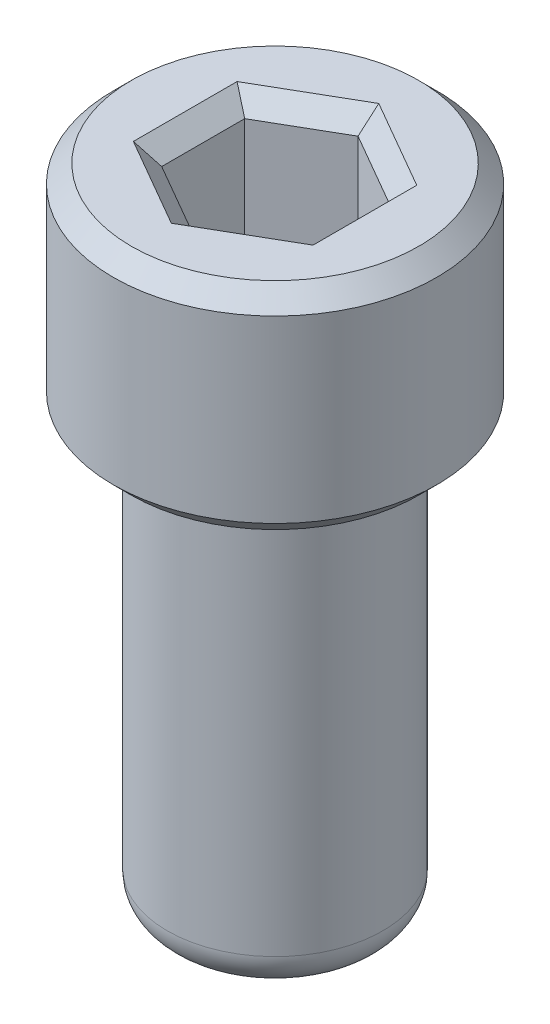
ISO-10303-21;
HEADER;
FILE_DESCRIPTION(('STEP AP214'),'2;1');
FILE_NAME('part.step','',(''),(''),'','','');
FILE_SCHEMA(('AUTOMOTIVE_DESIGN { 1 0 10303 214 1 1 1 1 }'));
ENDSEC;
DATA;
#1=APPLICATION_CONTEXT('core data for automotive mechanical design processes');
#2=APPLICATION_PROTOCOL_DEFINITION('international standard','automotive_design',2000,#1);
#3=PRODUCT_CONTEXT('',#1,'mechanical');
#4=PRODUCT('Part','Part','',(#3));
#5=PRODUCT_RELATED_PRODUCT_CATEGORY('part','',(#4));
#6=PRODUCT_DEFINITION_FORMATION('','',#4);
#7=PRODUCT_DEFINITION_CONTEXT('part definition',#1,'design');
#8=PRODUCT_DEFINITION('design','',#6,#7);
#9=PRODUCT_DEFINITION_SHAPE('','',#8);
#10=(LENGTH_UNIT() NAMED_UNIT(*) SI_UNIT(.MILLI.,.METRE.));
#11=(NAMED_UNIT(*) PLANE_ANGLE_UNIT() SI_UNIT($,.RADIAN.));
#12=(NAMED_UNIT(*) SI_UNIT($,.STERADIAN.) SOLID_ANGLE_UNIT());
#13=UNCERTAINTY_MEASURE_WITH_UNIT(LENGTH_MEASURE(1.E-05),#10,'distance_accuracy_value','');
#14=(GEOMETRIC_REPRESENTATION_CONTEXT(3) GLOBAL_UNCERTAINTY_ASSIGNED_CONTEXT((#13)) GLOBAL_UNIT_ASSIGNED_CONTEXT((#10,
#11,#12)) REPRESENTATION_CONTEXT('',''));
#15=CARTESIAN_POINT('',(0.,0.,0.));
#16=DIRECTION('',(0.,0.,1.));
#17=DIRECTION('',(1.,0.,0.));
#18=AXIS2_PLACEMENT_3D('',#15,#16,#17);
#19=CARTESIAN_POINT('',(0.,6.,0.));
#20=DIRECTION('',(0.,-1.,0.));
#21=DIRECTION('',(0.,0.,-1.));
#22=AXIS2_PLACEMENT_3D('',#19,#20,#21);
#23=CYLINDRICAL_SURFACE('',#22,1.5);
#24=CARTESIAN_POINT('',(0.,0.5,0.));
#25=DIRECTION('',(0.,1.,0.));
#26=DIRECTION('',(0.,0.,1.));
#27=AXIS2_PLACEMENT_3D('',#24,#25,#26);
#28=CIRCLE('',#27,1.5);
#29=CARTESIAN_POINT('',(0.,0.5,1.5));
#30=VERTEX_POINT('',#29);
#31=EDGE_CURVE('E51',#30,#30,#28,.T.);
#32=ORIENTED_EDGE('',*,*,#31,.T.);
#33=EDGE_LOOP('',(#32));
#34=FACE_BOUND('',#33,.T.);
#35=CARTESIAN_POINT('',(0.,6.,0.));
#36=DIRECTION('',(0.,1.,0.));
#37=DIRECTION('',(0.,0.,1.));
#38=AXIS2_PLACEMENT_3D('',#35,#36,#37);
#39=CIRCLE('',#38,1.5);
#40=CARTESIAN_POINT('',(0.,6.,1.5));
#41=VERTEX_POINT('',#40);
#42=EDGE_CURVE('E155',#41,#41,#39,.T.);
#43=ORIENTED_EDGE('',*,*,#42,.F.);
#44=EDGE_LOOP('',(#43));
#45=FACE_BOUND('',#44,.T.);
#46=ADVANCED_FACE('F43',(#34,#45),#23,.T.);
#47=CARTESIAN_POINT('',(0.,0.,0.));
#48=DIRECTION('',(0.,1.,0.));
#49=DIRECTION('',(0.,0.,1.));
#50=AXIS2_PLACEMENT_3D('',#47,#48,#49);
#51=PLANE('',#50);
#52=CARTESIAN_POINT('',(0.,0.,0.));
#53=DIRECTION('',(0.,1.,0.));
#54=DIRECTION('',(0.,0.,1.));
#55=AXIS2_PLACEMENT_3D('',#52,#53,#54);
#56=CIRCLE('',#55,1.);
#57=CARTESIAN_POINT('',(0.,0.,1.));
#58=VERTEX_POINT('',#57);
#59=EDGE_CURVE('E11',#58,#58,#56,.F.);
#60=ORIENTED_EDGE('',*,*,#59,.T.);
#61=EDGE_LOOP('',(#60));
#62=FACE_BOUND('',#61,.T.);
#63=ADVANCED_FACE('F229',(#62),#51,.F.);
#64=CARTESIAN_POINT('',(0.,9.,0.));
#65=DIRECTION('',(0.,-1.,0.));
#66=DIRECTION('',(0.,0.,-1.));
#67=AXIS2_PLACEMENT_3D('',#64,#65,#66);
#68=CYLINDRICAL_SURFACE('',#67,2.25);
#69=CARTESIAN_POINT('',(0.,6.25,0.));
#70=DIRECTION('',(0.,1.,0.));
#71=DIRECTION('',(0.,0.,1.));
#72=AXIS2_PLACEMENT_3D('',#69,#70,#71);
#73=CIRCLE('',#72,2.25);
#74=CARTESIAN_POINT('',(0.,6.25,2.25));
#75=VERTEX_POINT('',#74);
#76=EDGE_CURVE('E169',#75,#75,#73,.T.);
#77=ORIENTED_EDGE('',*,*,#76,.T.);
#78=EDGE_LOOP('',(#77));
#79=FACE_BOUND('',#78,.T.);
#80=CARTESIAN_POINT('',(0.,8.75,0.));
#81=DIRECTION('',(0.,1.,0.));
#82=DIRECTION('',(0.,0.,1.));
#83=AXIS2_PLACEMENT_3D('',#80,#81,#82);
#84=CIRCLE('',#83,2.25);
#85=CARTESIAN_POINT('',(0.,8.75,2.25));
#86=VERTEX_POINT('',#85);
#87=EDGE_CURVE('E166',#86,#86,#84,.F.);
#88=ORIENTED_EDGE('',*,*,#87,.T.);
#89=EDGE_LOOP('',(#88));
#90=FACE_BOUND('',#89,.T.);
#91=ADVANCED_FACE('F233',(#79,#90),#68,.T.);
#92=CARTESIAN_POINT('',(0.,9.,0.));
#93=DIRECTION('',(0.,1.,0.));
#94=DIRECTION('',(0.,0.,1.));
#95=AXIS2_PLACEMENT_3D('',#92,#93,#94);
#96=PLANE('',#95);
#97=CARTESIAN_POINT('',(0.,9.,0.));
#98=DIRECTION('',(0.,1.,0.));
#99=DIRECTION('',(0.,0.,1.));
#100=AXIS2_PLACEMENT_3D('',#97,#98,#99);
#101=CIRCLE('',#100,2.);
#102=CARTESIAN_POINT('',(0.,9.,2.));
#103=VERTEX_POINT('',#102);
#104=EDGE_CURVE('E188',#103,#103,#101,.T.);
#105=ORIENTED_EDGE('',*,*,#104,.T.);
#106=EDGE_LOOP('',(#105));
#107=FACE_BOUND('',#106,.T.);
#108=DIRECTION('',(-0.866025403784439,0.,0.5));
#109=VECTOR('',#108,1.);
#110=CARTESIAN_POINT('',(0.125000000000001,9.,1.37120688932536));
#111=LINE('',#110,#109);
#112=CARTESIAN_POINT('',(1.25,9.,0.721687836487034));
#113=VERTEX_POINT('',#112);
#114=CARTESIAN_POINT('',(0.,9.,1.44337567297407));
#115=VERTEX_POINT('',#114);
#116=EDGE_CURVE('E175',#113,#115,#111,.T.);
#117=ORIENTED_EDGE('',*,*,#116,.T.);
#118=DIRECTION('',(-0.866025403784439,0.,-0.5));
#119=VECTOR('',#118,1.);
#120=CARTESIAN_POINT('',(-1.125,9.,0.793856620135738));
#121=LINE('',#120,#119);
#122=CARTESIAN_POINT('',(-1.25,9.,0.721687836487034));
#123=VERTEX_POINT('',#122);
#124=EDGE_CURVE('E185',#115,#123,#121,.T.);
#125=ORIENTED_EDGE('',*,*,#124,.T.);
#126=DIRECTION('',(0.,0.,-1.));
#127=VECTOR('',#126,1.);
#128=CARTESIAN_POINT('',(-1.25,9.,-0.577350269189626));
#129=LINE('',#128,#127);
#130=CARTESIAN_POINT('',(-1.25,9.,-0.721687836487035));
#131=VERTEX_POINT('',#130);
#132=EDGE_CURVE('E183',#123,#131,#129,.T.);
#133=ORIENTED_EDGE('',*,*,#132,.T.);
#134=DIRECTION('',(0.866025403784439,0.,-0.5));
#135=VECTOR('',#134,1.);
#136=CARTESIAN_POINT('',(-0.125000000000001,9.,-1.37120688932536));
#137=LINE('',#136,#135);
#138=CARTESIAN_POINT('',(0.,9.,-1.44337567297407));
#139=VERTEX_POINT('',#138);
#140=EDGE_CURVE('E181',#131,#139,#137,.T.);
#141=ORIENTED_EDGE('',*,*,#140,.T.);
#142=DIRECTION('',(0.866025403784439,0.,0.5));
#143=VECTOR('',#142,1.);
#144=CARTESIAN_POINT('',(1.125,9.,-0.793856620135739));
#145=LINE('',#144,#143);
#146=CARTESIAN_POINT('',(1.25,9.,-0.721687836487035));
#147=VERTEX_POINT('',#146);
#148=EDGE_CURVE('E179',#139,#147,#145,.T.);
#149=ORIENTED_EDGE('',*,*,#148,.T.);
#150=DIRECTION('',(0.,0.,1.));
#151=VECTOR('',#150,1.);
#152=CARTESIAN_POINT('',(1.25,9.,0.577350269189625));
#153=LINE('',#152,#151);
#154=EDGE_CURVE('E177',#147,#113,#153,.T.);
#155=ORIENTED_EDGE('',*,*,#154,.T.);
#156=EDGE_LOOP('',(#117,#125,#133,#141,#149,#155));
#157=FACE_BOUND('',#156,.T.);
#158=ADVANCED_FACE('F295',(#107,#157),#96,.T.);
#159=CARTESIAN_POINT('',(0.,6.,0.));
#160=DIRECTION('',(0.,1.,0.));
#161=DIRECTION('',(0.,0.,1.));
#162=AXIS2_PLACEMENT_3D('',#159,#160,#161);
#163=PLANE('',#162);
#164=CARTESIAN_POINT('',(0.,6.,0.));
#165=DIRECTION('',(0.,1.,0.));
#166=DIRECTION('',(0.,0.,1.));
#167=AXIS2_PLACEMENT_3D('',#164,#165,#166);
#168=CIRCLE('',#167,2.);
#169=CARTESIAN_POINT('',(0.,6.,2.));
#170=VERTEX_POINT('',#169);
#171=EDGE_CURVE('E172',#170,#170,#168,.F.);
#172=ORIENTED_EDGE('',*,*,#171,.T.);
#173=EDGE_LOOP('',(#172));
#174=FACE_BOUND('',#173,.T.);
#175=ORIENTED_EDGE('',*,*,#42,.T.);
#176=EDGE_LOOP('',(#175));
#177=FACE_BOUND('',#176,.T.);
#178=ADVANCED_FACE('F329',(#174,#177),#163,.F.);
#179=CARTESIAN_POINT('',(1.,7.,-0.577350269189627));
#180=DIRECTION('',(0.5,0.,-0.866025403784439));
#181=DIRECTION('',(-0.866025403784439,0.,-0.5));
#182=AXIS2_PLACEMENT_3D('',#179,#180,#181);
#183=PLANE('',#182);
#184=DIRECTION('',(0.,1.,0.));
#185=VECTOR('',#184,1.);
#186=CARTESIAN_POINT('',(1.,7.,-0.577350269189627));
#187=LINE('',#186,#185);
#188=CARTESIAN_POINT('',(1.,7.,-0.577350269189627));
#189=VERTEX_POINT('',#188);
#190=CARTESIAN_POINT('',(1.,8.75,-0.577350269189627));
#191=VERTEX_POINT('',#190);
#192=EDGE_CURVE('E153',#189,#191,#187,.T.);
#193=ORIENTED_EDGE('',*,*,#192,.T.);
#194=DIRECTION('',(-0.866025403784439,0.,-0.5));
#195=VECTOR('',#194,1.);
#196=CARTESIAN_POINT('',(0.,8.75,-1.15470053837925));
#197=LINE('',#196,#195);
#198=CARTESIAN_POINT('',(0.,8.75,-1.15470053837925));
#199=VERTEX_POINT('',#198);
#200=EDGE_CURVE('E122',#191,#199,#197,.T.);
#201=ORIENTED_EDGE('',*,*,#200,.T.);
#202=DIRECTION('',(0.,1.,0.));
#203=VECTOR('',#202,1.);
#204=CARTESIAN_POINT('',(0.,7.,-1.15470053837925));
#205=LINE('',#204,#203);
#206=CARTESIAN_POINT('',(0.,7.,-1.15470053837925));
#207=VERTEX_POINT('',#206);
#208=EDGE_CURVE('E115',#207,#199,#205,.T.);
#209=ORIENTED_EDGE('',*,*,#208,.F.);
#210=DIRECTION('',(-0.866025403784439,0.,-0.5));
#211=VECTOR('',#210,1.);
#212=CARTESIAN_POINT('',(1.,7.,-0.577350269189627));
#213=LINE('',#212,#211);
#214=EDGE_CURVE('E119',#189,#207,#213,.T.);
#215=ORIENTED_EDGE('',*,*,#214,.F.);
#216=EDGE_LOOP('',(#193,#201,#209,#215));
#217=FACE_BOUND('',#216,.T.);
#218=ADVANCED_FACE('F117',(#217),#183,.F.);
#219=CARTESIAN_POINT('',(1.,7.,0.577350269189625));
#220=DIRECTION('',(1.,0.,0.));
#221=DIRECTION('',(0.,0.,-1.));
#222=AXIS2_PLACEMENT_3D('',#219,#220,#221);
#223=PLANE('',#222);
#224=DIRECTION('',(0.,1.,0.));
#225=VECTOR('',#224,1.);
#226=CARTESIAN_POINT('',(1.,7.,0.577350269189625));
#227=LINE('',#226,#225);
#228=CARTESIAN_POINT('',(1.,7.,0.577350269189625));
#229=VERTEX_POINT('',#228);
#230=CARTESIAN_POINT('',(1.,8.75,0.577350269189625));
#231=VERTEX_POINT('',#230);
#232=EDGE_CURVE('E156',#229,#231,#227,.T.);
#233=ORIENTED_EDGE('',*,*,#232,.T.);
#234=DIRECTION('',(0.,0.,-1.));
#235=VECTOR('',#234,1.);
#236=CARTESIAN_POINT('',(1.,8.75,-0.577350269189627));
#237=LINE('',#236,#235);
#238=EDGE_CURVE('E65',#231,#191,#237,.T.);
#239=ORIENTED_EDGE('',*,*,#238,.T.);
#240=ORIENTED_EDGE('',*,*,#192,.F.);
#241=DIRECTION('',(0.,0.,-1.));
#242=VECTOR('',#241,1.);
#243=CARTESIAN_POINT('',(1.,7.,0.577350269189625));
#244=LINE('',#243,#242);
#245=EDGE_CURVE('E126',#229,#189,#244,.T.);
#246=ORIENTED_EDGE('',*,*,#245,.F.);
#247=EDGE_LOOP('',(#233,#239,#240,#246));
#248=FACE_BOUND('',#247,.T.);
#249=ADVANCED_FACE('F310',(#248),#223,.F.);
#250=CARTESIAN_POINT('',(0.,7.,1.15470053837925));
#251=DIRECTION('',(0.5,0.,0.866025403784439));
#252=DIRECTION('',(0.866025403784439,0.,-0.5));
#253=AXIS2_PLACEMENT_3D('',#250,#251,#252);
#254=PLANE('',#253);
#255=DIRECTION('',(0.,1.,0.));
#256=VECTOR('',#255,1.);
#257=CARTESIAN_POINT('',(0.,7.,1.15470053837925));
#258=LINE('',#257,#256);
#259=CARTESIAN_POINT('',(0.,7.,1.15470053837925));
#260=VERTEX_POINT('',#259);
#261=CARTESIAN_POINT('',(0.,8.75,1.15470053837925));
#262=VERTEX_POINT('',#261);
#263=EDGE_CURVE('E158',#260,#262,#258,.T.);
#264=ORIENTED_EDGE('',*,*,#263,.T.);
#265=DIRECTION('',(0.866025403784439,0.,-0.5));
#266=VECTOR('',#265,1.);
#267=CARTESIAN_POINT('',(1.,8.75,0.577350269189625));
#268=LINE('',#267,#266);
#269=EDGE_CURVE('E58',#262,#231,#268,.T.);
#270=ORIENTED_EDGE('',*,*,#269,.T.);
#271=ORIENTED_EDGE('',*,*,#232,.F.);
#272=DIRECTION('',(0.866025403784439,0.,-0.5));
#273=VECTOR('',#272,1.);
#274=CARTESIAN_POINT('',(0.,7.,1.15470053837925));
#275=LINE('',#274,#273);
#276=EDGE_CURVE('E150',#260,#229,#275,.T.);
#277=ORIENTED_EDGE('',*,*,#276,.F.);
#278=EDGE_LOOP('',(#264,#270,#271,#277));
#279=FACE_BOUND('',#278,.T.);
#280=ADVANCED_FACE('F312',(#279),#254,.F.);
#281=CARTESIAN_POINT('',(-1.,7.,0.577350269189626));
#282=DIRECTION('',(-0.5,0.,0.866025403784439));
#283=DIRECTION('',(0.866025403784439,0.,0.5));
#284=AXIS2_PLACEMENT_3D('',#281,#282,#283);
#285=PLANE('',#284);
#286=DIRECTION('',(0.,1.,0.));
#287=VECTOR('',#286,1.);
#288=CARTESIAN_POINT('',(-1.,7.,0.577350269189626));
#289=LINE('',#288,#287);
#290=CARTESIAN_POINT('',(-1.,7.,0.577350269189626));
#291=VERTEX_POINT('',#290);
#292=CARTESIAN_POINT('',(-1.,8.75,0.577350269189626));
#293=VERTEX_POINT('',#292);
#294=EDGE_CURVE('E160',#291,#293,#289,.T.);
#295=ORIENTED_EDGE('',*,*,#294,.T.);
#296=DIRECTION('',(0.866025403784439,0.,0.5));
#297=VECTOR('',#296,1.);
#298=CARTESIAN_POINT('',(0.,8.75,1.15470053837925));
#299=LINE('',#298,#297);
#300=EDGE_CURVE('E191',#293,#262,#299,.T.);
#301=ORIENTED_EDGE('',*,*,#300,.T.);
#302=ORIENTED_EDGE('',*,*,#263,.F.);
#303=DIRECTION('',(0.866025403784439,0.,0.5));
#304=VECTOR('',#303,1.);
#305=CARTESIAN_POINT('',(-1.,7.,0.577350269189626));
#306=LINE('',#305,#304);
#307=EDGE_CURVE('E147',#291,#260,#306,.T.);
#308=ORIENTED_EDGE('',*,*,#307,.F.);
#309=EDGE_LOOP('',(#295,#301,#302,#308));
#310=FACE_BOUND('',#309,.T.);
#311=ADVANCED_FACE('F308',(#310),#285,.F.);
#312=CARTESIAN_POINT('',(-1.,7.,-0.577350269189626));
#313=DIRECTION('',(-1.,0.,0.));
#314=DIRECTION('',(0.,0.,1.));
#315=AXIS2_PLACEMENT_3D('',#312,#313,#314);
#316=PLANE('',#315);
#317=DIRECTION('',(0.,1.,0.));
#318=VECTOR('',#317,1.);
#319=CARTESIAN_POINT('',(-1.,7.,-0.577350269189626));
#320=LINE('',#319,#318);
#321=CARTESIAN_POINT('',(-1.,7.,-0.577350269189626));
#322=VERTEX_POINT('',#321);
#323=CARTESIAN_POINT('',(-1.,8.75,-0.577350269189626));
#324=VERTEX_POINT('',#323);
#325=EDGE_CURVE('E125',#322,#324,#320,.T.);
#326=ORIENTED_EDGE('',*,*,#325,.T.);
#327=DIRECTION('',(0.,0.,1.));
#328=VECTOR('',#327,1.);
#329=CARTESIAN_POINT('',(-1.,8.75,0.577350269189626));
#330=LINE('',#329,#328);
#331=EDGE_CURVE('E194',#324,#293,#330,.T.);
#332=ORIENTED_EDGE('',*,*,#331,.T.);
#333=ORIENTED_EDGE('',*,*,#294,.F.);
#334=DIRECTION('',(0.,0.,1.));
#335=VECTOR('',#334,1.);
#336=CARTESIAN_POINT('',(-1.,7.,-0.577350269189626));
#337=LINE('',#336,#335);
#338=EDGE_CURVE('E135',#322,#291,#337,.T.);
#339=ORIENTED_EDGE('',*,*,#338,.F.);
#340=EDGE_LOOP('',(#326,#332,#333,#339));
#341=FACE_BOUND('',#340,.T.);
#342=ADVANCED_FACE('F305',(#341),#316,.F.);
#343=CARTESIAN_POINT('',(0.,7.,-1.15470053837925));
#344=DIRECTION('',(-0.5,0.,-0.866025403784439));
#345=DIRECTION('',(-0.866025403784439,0.,0.5));
#346=AXIS2_PLACEMENT_3D('',#343,#344,#345);
#347=PLANE('',#346);
#348=ORIENTED_EDGE('',*,*,#208,.T.);
#349=DIRECTION('',(-0.866025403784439,0.,0.5));
#350=VECTOR('',#349,1.);
#351=CARTESIAN_POINT('',(-1.,8.75,-0.577350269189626));
#352=LINE('',#351,#350);
#353=EDGE_CURVE('E196',#199,#324,#352,.T.);
#354=ORIENTED_EDGE('',*,*,#353,.T.);
#355=ORIENTED_EDGE('',*,*,#325,.F.);
#356=DIRECTION('',(-0.866025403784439,0.,0.5));
#357=VECTOR('',#356,1.);
#358=CARTESIAN_POINT('',(0.,7.,-1.15470053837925));
#359=LINE('',#358,#357);
#360=EDGE_CURVE('E129',#207,#322,#359,.T.);
#361=ORIENTED_EDGE('',*,*,#360,.F.);
#362=EDGE_LOOP('',(#348,#354,#355,#361));
#363=FACE_BOUND('',#362,.T.);
#364=ADVANCED_FACE('F130',(#363),#347,.F.);
#365=CARTESIAN_POINT('',(0.,7.,0.));
#366=DIRECTION('',(0.,1.,0.));
#367=DIRECTION('',(0.,0.,1.));
#368=AXIS2_PLACEMENT_3D('',#365,#366,#367);
#369=PLANE('',#368);
#370=ORIENTED_EDGE('',*,*,#214,.T.);
#371=ORIENTED_EDGE('',*,*,#360,.T.);
#372=ORIENTED_EDGE('',*,*,#338,.T.);
#373=ORIENTED_EDGE('',*,*,#307,.T.);
#374=ORIENTED_EDGE('',*,*,#276,.T.);
#375=ORIENTED_EDGE('',*,*,#245,.T.);
#376=EDGE_LOOP('',(#370,#371,#372,#373,#374,#375));
#377=FACE_BOUND('',#376,.T.);
#378=ADVANCED_FACE('F137',(#377),#369,.T.);
#379=CARTESIAN_POINT('',(0.,6.25,0.));
#380=DIRECTION('',(0.,1.,0.));
#381=DIRECTION('',(0.,0.,1.));
#382=AXIS2_PLACEMENT_3D('',#379,#380,#381);
#383=CONICAL_SURFACE('',#382,2.25,0.785398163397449);
#384=ORIENTED_EDGE('',*,*,#171,.F.);
#385=EDGE_LOOP('',(#384));
#386=FACE_BOUND('',#385,.T.);
#387=ORIENTED_EDGE('',*,*,#76,.F.);
#388=EDGE_LOOP('',(#387));
#389=FACE_BOUND('',#388,.T.);
#390=ADVANCED_FACE('F239',(#386,#389),#383,.T.);
#391=CARTESIAN_POINT('',(0.,9.,0.));
#392=DIRECTION('',(0.,-1.,0.));
#393=DIRECTION('',(0.,0.,-1.));
#394=AXIS2_PLACEMENT_3D('',#391,#392,#393);
#395=CONICAL_SURFACE('',#394,2.,0.785398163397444);
#396=ORIENTED_EDGE('',*,*,#87,.F.);
#397=EDGE_LOOP('',(#396));
#398=FACE_BOUND('',#397,.T.);
#399=ORIENTED_EDGE('',*,*,#104,.F.);
#400=EDGE_LOOP('',(#399));
#401=FACE_BOUND('',#400,.T.);
#402=ADVANCED_FACE('F245',(#398,#401),#395,.T.);
#403=CARTESIAN_POINT('',(1.,8.75,-0.577350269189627));
#404=DIRECTION('',(-0.353553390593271,0.707106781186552,0.612372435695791));
#405=DIRECTION('',(0.866025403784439,0.,0.5));
#406=AXIS2_PLACEMENT_3D('',#403,#404,#405);
#407=PLANE('',#406);
#408=DIRECTION('',(-0.654653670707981,-0.654653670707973,0.377964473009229));
#409=VECTOR('',#408,1.);
#410=CARTESIAN_POINT('',(1.,8.75,-0.577350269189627));
#411=LINE('',#410,#409);
#412=EDGE_CURVE('E143',#147,#191,#411,.T.);
#413=ORIENTED_EDGE('',*,*,#412,.F.);
#414=ORIENTED_EDGE('',*,*,#148,.F.);
#415=DIRECTION('',(0.,-0.654653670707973,0.755928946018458));
#416=VECTOR('',#415,1.);
#417=CARTESIAN_POINT('',(0.,8.75,-1.15470053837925));
#418=LINE('',#417,#416);
#419=EDGE_CURVE('E140',#199,#139,#418,.F.);
#420=ORIENTED_EDGE('',*,*,#419,.F.);
#421=ORIENTED_EDGE('',*,*,#200,.F.);
#422=EDGE_LOOP('',(#413,#414,#420,#421));
#423=FACE_BOUND('',#422,.T.);
#424=ADVANCED_FACE('F251',(#423),#407,.T.);
#425=CARTESIAN_POINT('',(0.,8.75,-1.15470053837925));
#426=DIRECTION('',(0.353553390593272,0.707106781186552,0.612372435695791));
#427=DIRECTION('',(0.866025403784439,0.,-0.5));
#428=AXIS2_PLACEMENT_3D('',#425,#426,#427);
#429=PLANE('',#428);
#430=ORIENTED_EDGE('',*,*,#419,.T.);
#431=ORIENTED_EDGE('',*,*,#140,.F.);
#432=DIRECTION('',(0.65465367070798,-0.654653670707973,0.377964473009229));
#433=VECTOR('',#432,1.);
#434=CARTESIAN_POINT('',(-1.,8.75,-0.577350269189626));
#435=LINE('',#434,#433);
#436=EDGE_CURVE('E208',#324,#131,#435,.F.);
#437=ORIENTED_EDGE('',*,*,#436,.F.);
#438=ORIENTED_EDGE('',*,*,#353,.F.);
#439=EDGE_LOOP('',(#430,#431,#437,#438));
#440=FACE_BOUND('',#439,.T.);
#441=ADVANCED_FACE('F277',(#440),#429,.T.);
#442=CARTESIAN_POINT('',(1.,8.75,0.577350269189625));
#443=DIRECTION('',(-0.707106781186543,0.707106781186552,0.));
#444=DIRECTION('',(0.,0.,1.));
#445=AXIS2_PLACEMENT_3D('',#442,#443,#444);
#446=PLANE('',#445);
#447=ORIENTED_EDGE('',*,*,#412,.T.);
#448=ORIENTED_EDGE('',*,*,#238,.F.);
#449=DIRECTION('',(-0.654653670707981,-0.654653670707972,-0.377964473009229));
#450=VECTOR('',#449,1.);
#451=CARTESIAN_POINT('',(1.,8.75,0.577350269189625));
#452=LINE('',#451,#450);
#453=EDGE_CURVE('E205',#113,#231,#452,.T.);
#454=ORIENTED_EDGE('',*,*,#453,.F.);
#455=ORIENTED_EDGE('',*,*,#154,.F.);
#456=EDGE_LOOP('',(#447,#448,#454,#455));
#457=FACE_BOUND('',#456,.T.);
#458=ADVANCED_FACE('F270',(#457),#446,.T.);
#459=CARTESIAN_POINT('',(-1.,8.75,-0.577350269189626));
#460=DIRECTION('',(0.707106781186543,0.707106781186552,0.));
#461=DIRECTION('',(0.,0.,-1.));
#462=AXIS2_PLACEMENT_3D('',#459,#460,#461);
#463=PLANE('',#462);
#464=ORIENTED_EDGE('',*,*,#436,.T.);
#465=ORIENTED_EDGE('',*,*,#132,.F.);
#466=DIRECTION('',(0.654653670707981,-0.654653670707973,-0.377964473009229));
#467=VECTOR('',#466,1.);
#468=CARTESIAN_POINT('',(-1.,8.75,0.577350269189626));
#469=LINE('',#468,#467);
#470=EDGE_CURVE('E203',#293,#123,#469,.F.);
#471=ORIENTED_EDGE('',*,*,#470,.F.);
#472=ORIENTED_EDGE('',*,*,#331,.F.);
#473=EDGE_LOOP('',(#464,#465,#471,#472));
#474=FACE_BOUND('',#473,.T.);
#475=ADVANCED_FACE('F263',(#474),#463,.T.);
#476=CARTESIAN_POINT('',(0.,8.75,1.15470053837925));
#477=DIRECTION('',(-0.353553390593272,0.707106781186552,-0.612372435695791));
#478=DIRECTION('',(-0.866025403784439,0.,0.5));
#479=AXIS2_PLACEMENT_3D('',#476,#477,#478);
#480=PLANE('',#479);
#481=ORIENTED_EDGE('',*,*,#453,.T.);
#482=ORIENTED_EDGE('',*,*,#269,.F.);
#483=DIRECTION('',(0.,0.654653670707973,0.755928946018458));
#484=VECTOR('',#483,1.);
#485=CARTESIAN_POINT('',(0.,8.46428571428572,0.824786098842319));
#486=LINE('',#485,#484);
#487=EDGE_CURVE('E201',#115,#262,#486,.F.);
#488=ORIENTED_EDGE('',*,*,#487,.F.);
#489=ORIENTED_EDGE('',*,*,#116,.F.);
#490=EDGE_LOOP('',(#481,#482,#488,#489));
#491=FACE_BOUND('',#490,.T.);
#492=ADVANCED_FACE('F224',(#491),#480,.T.);
#493=CARTESIAN_POINT('',(-1.,8.75,0.577350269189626));
#494=DIRECTION('',(0.353553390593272,0.707106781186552,-0.612372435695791));
#495=DIRECTION('',(-0.866025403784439,0.,-0.5));
#496=AXIS2_PLACEMENT_3D('',#493,#494,#495);
#497=PLANE('',#496);
#498=ORIENTED_EDGE('',*,*,#470,.T.);
#499=ORIENTED_EDGE('',*,*,#124,.F.);
#500=ORIENTED_EDGE('',*,*,#487,.T.);
#501=ORIENTED_EDGE('',*,*,#300,.F.);
#502=EDGE_LOOP('',(#498,#499,#500,#501));
#503=FACE_BOUND('',#502,.T.);
#504=ADVANCED_FACE('F218',(#503),#497,.T.);
#505=CARTESIAN_POINT('',(0.,0.5,0.));
#506=DIRECTION('',(0.,1.,0.));
#507=DIRECTION('',(0.,0.,1.));
#508=AXIS2_PLACEMENT_3D('',#505,#506,#507);
#509=TOROIDAL_SURFACE('',#508,1.,0.5);
#510=ORIENTED_EDGE('',*,*,#59,.F.);
#511=EDGE_LOOP('',(#510));
#512=FACE_BOUND('',#511,.T.);
#513=ORIENTED_EDGE('',*,*,#31,.F.);
#514=EDGE_LOOP('',(#513));
#515=FACE_BOUND('',#514,.T.);
#516=ADVANCED_FACE('F45',(#512,#515),#509,.T.);
#517=CLOSED_SHELL('',(#46,#63,#91,#158,#178,#218,#249,#280,#311,#342,#364,#378,#390,#402,#424,
#441,#458,#475,#492,#504,#516));
#518=MANIFOLD_SOLID_BREP('B2',#517);
#519=ADVANCED_BREP_SHAPE_REPRESENTATION('',(#18,#518),#14);
#520=SHAPE_DEFINITION_REPRESENTATION(#9,#519);
ENDSEC;
END-ISO-10303-21;
